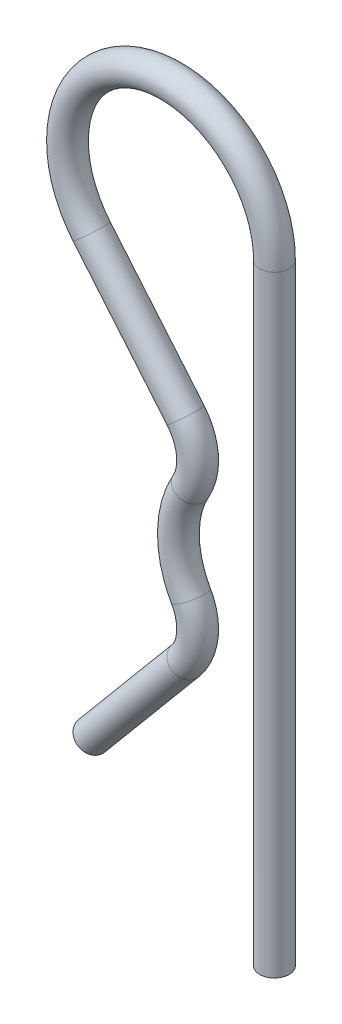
from build123d import *

# Parameters (mm, degrees)
ESQUISSE2_R = 0.75


with BuildPart() as part:
    # Base-Balayage: sweep along a path in Esquisse4
    with BuildLine(Plane.XY) as base_balayage_path:
        Line((0, -16.549113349), (0, 14.450886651))
        ThreePointArc((0, 14.450886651), (-7.042682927, 19.385335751), (-9.275728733, 11.081018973))
        Line((-9.275728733, 11.081018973), (-4.509603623, 5.387285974))
        ThreePointArc((-4.509603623, 5.387285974), (-3.908171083, 3.9391573), (-4.239604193, 2.406528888))
        ThreePointArc((-4.239604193, 2.406528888), (-4.875, 0), (-4.239604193, -2.406528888))
        ThreePointArc((-4.239604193, -2.406528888), (-3.908171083, -3.9391573), (-4.509603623, -5.387285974))
        Line((-4.509603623, -5.387285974), (-9.275728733, -11.081018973))
    # Esquisse2 → Base-Balayage (sweep)
    with BuildSketch(Plane(origin=(0, -16.549113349, 0), x_dir=(1, 0, 0), z_dir=(0, 1, 0))):
        Circle(ESQUISSE2_R)
    sweep(path=base_balayage_path.line)


solid = part.part
